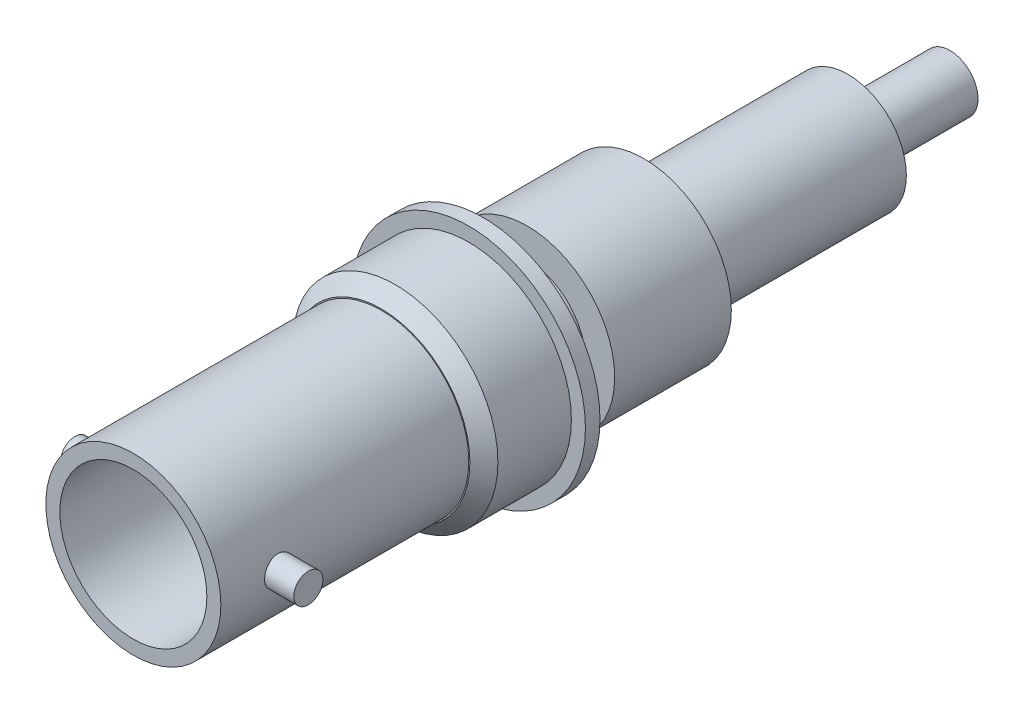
from build123d import *

# Parameters (mm, degrees)
SKETCH1_R           = 6.35
EXTRUDE1_DEPTH      = 0.79375
SKETCH2_R           = 4.7625
SKETCH2_R_2         = 4.0005
EXTRUDE_THIN1_DEPTH = 18.25625
SKETCH3_R           = 0.79375
EXTRUDE2_DEPTH      = 6.35
SKETCH4_R           = 4.0005
CUT_EXTRUDE1_DEPTH  = 22.060567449
EXTRUDE3_START      = 4.7625
SKETCH5_R           = 5.588
SKETCH5_R_2         = 4.0005
EXTRUDE3_DEPTH      = 4.7625
CHAMFER1_SIZE       = 0.762


with BuildPart() as part:
    # Sketch1 → Extrude1 (new body)
    with BuildSketch(Plane.XY):
        Circle(SKETCH1_R)
    extrude(amount=EXTRUDE1_DEPTH)

    # Sketch2 → Extrude-Thin1 (add)
    with BuildSketch(Plane.XY.offset(0.79375)):
        Circle(SKETCH2_R)
        Circle(SKETCH2_R_2, mode=Mode.SUBTRACT)
    extrude(amount=EXTRUDE_THIN1_DEPTH)

    # Sketch3 → Extrude2 (add, symmetric)
    with BuildSketch(Plane(origin=(0, 0, 0), x_dir=(0, 0, -1), z_dir=(1, 0, 0))):
        with Locations(Location((-15.875, 0, 0), (0, 0, 180))):
            Circle(SKETCH3_R)
    extrude(amount=EXTRUDE2_DEPTH, both=True)

    # Sketch4 → Cut-Extrude1 (cut, through all)
    with BuildSketch(Plane.XY.offset(19.05)):
        Circle(SKETCH4_R)
    extrude(amount=-CUT_EXTRUDE1_DEPTH, mode=Mode.SUBTRACT)

    # Sketch5 → Extrude3 (add)
    with BuildSketch(Plane.XY.offset(0.79375).offset(EXTRUDE3_START)):
        with Locations(Location((0, 0, 0), (0, 0, 180))):
            Circle(SKETCH5_R)
        Circle(SKETCH5_R_2, mode=Mode.SUBTRACT)
    extrude(amount=-EXTRUDE3_DEPTH)

    # Chamfer1
    chamfer1_edges = [part.edges().sort_by_distance(p)[0] for p in [
        (5.588, 0, 5.55625),
    ]]
    chamfer(chamfer1_edges, length=CHAMFER1_SIZE)

    # Sketch6 → Revolve1 (revolve)
    with BuildSketch(Plane(origin=(0, 0, 0), x_dir=(1, 0, 0), z_dir=(0, 1, 0))):
        Polygon((0, 0), (0, 25.4), (1.524, 25.4), (1.524, 19.8501), (3.175, 19.8501), (3.175, 8.7376), (4.7625, 8.7376), (4.7625, 2.3876), (3.175, 2.3876), (3.175, 0.8128), (4.7625, 0.8128), (4.7625, 0), align=None)
    revolve(axis=Axis((0, 0, 0), (0, 0, -1)))


solid = part.part
